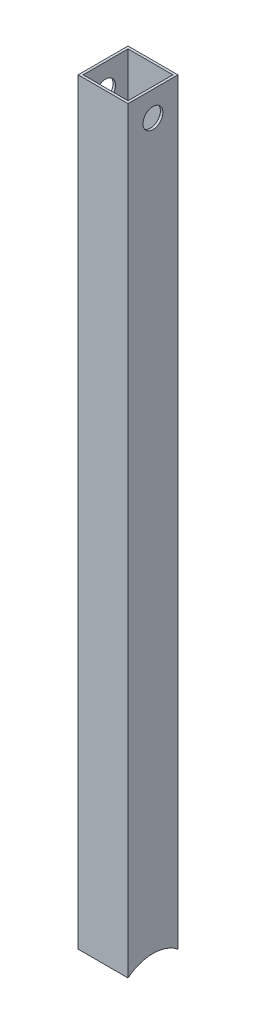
ISO-10303-21;
HEADER;
FILE_DESCRIPTION(('STEP AP214'),'2;1');
FILE_NAME('part.step','',(''),(''),'','','');
FILE_SCHEMA(('AUTOMOTIVE_DESIGN { 1 0 10303 214 1 1 1 1 }'));
ENDSEC;
DATA;
#1=APPLICATION_CONTEXT('core data for automotive mechanical design processes');
#2=APPLICATION_PROTOCOL_DEFINITION('international standard','automotive_design',2000,#1);
#3=PRODUCT_CONTEXT('',#1,'mechanical');
#4=PRODUCT('Part','Part','',(#3));
#5=PRODUCT_RELATED_PRODUCT_CATEGORY('part','',(#4));
#6=PRODUCT_DEFINITION_FORMATION('','',#4);
#7=PRODUCT_DEFINITION_CONTEXT('part definition',#1,'design');
#8=PRODUCT_DEFINITION('design','',#6,#7);
#9=PRODUCT_DEFINITION_SHAPE('','',#8);
#10=(LENGTH_UNIT() NAMED_UNIT(*) SI_UNIT(.MILLI.,.METRE.));
#11=(NAMED_UNIT(*) PLANE_ANGLE_UNIT() SI_UNIT($,.RADIAN.));
#12=(NAMED_UNIT(*) SI_UNIT($,.STERADIAN.) SOLID_ANGLE_UNIT());
#13=UNCERTAINTY_MEASURE_WITH_UNIT(LENGTH_MEASURE(1.E-05),#10,'distance_accuracy_value','');
#14=(GEOMETRIC_REPRESENTATION_CONTEXT(3) GLOBAL_UNCERTAINTY_ASSIGNED_CONTEXT((#13)) GLOBAL_UNIT_ASSIGNED_CONTEXT((#10,
#11,#12)) REPRESENTATION_CONTEXT('',''));
#15=CARTESIAN_POINT('',(0.,0.,0.));
#16=DIRECTION('',(0.,0.,1.));
#17=DIRECTION('',(1.,0.,0.));
#18=AXIS2_PLACEMENT_3D('',#15,#16,#17);
#19=CARTESIAN_POINT('',(25.,790.,-25.));
#20=DIRECTION('',(-1.,0.,0.));
#21=DIRECTION('',(0.,0.,1.));
#22=AXIS2_PLACEMENT_3D('',#19,#20,#21);
#23=PLANE('',#22);
#24=CARTESIAN_POINT('',(25.,764.99256211,0.));
#25=DIRECTION('',(1.,0.,0.));
#26=DIRECTION('',(0.,0.,-1.));
#27=AXIS2_PLACEMENT_3D('',#24,#25,#26);
#28=CIRCLE('',#27,9.99999999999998);
#29=CARTESIAN_POINT('',(25.,764.99256211,-9.99999999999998));
#30=VERTEX_POINT('',#29);
#31=EDGE_CURVE('E116',#30,#30,#28,.T.);
#32=ORIENTED_EDGE('',*,*,#31,.F.);
#33=EDGE_LOOP('',(#32));
#34=FACE_BOUND('',#33,.T.);
#35=DIRECTION('',(0.,-1.,0.));
#36=VECTOR('',#35,1.);
#37=CARTESIAN_POINT('',(25.,790.,25.));
#38=LINE('',#37,#36);
#39=CARTESIAN_POINT('',(25.,790.,25.));
#40=VERTEX_POINT('',#39);
#41=CARTESIAN_POINT('',(25.,31.2249899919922,25.));
#42=VERTEX_POINT('',#41);
#43=EDGE_CURVE('E123',#40,#42,#38,.T.);
#44=ORIENTED_EDGE('',*,*,#43,.T.);
#45=CARTESIAN_POINT('',(25.,0.,0.));
#46=DIRECTION('',(1.,0.,0.));
#47=DIRECTION('',(0.,0.,-1.));
#48=AXIS2_PLACEMENT_3D('',#45,#46,#47);
#49=CIRCLE('',#48,40.);
#50=CARTESIAN_POINT('',(25.,31.224989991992,-25.));
#51=VERTEX_POINT('',#50);
#52=EDGE_CURVE('E52',#51,#42,#49,.T.);
#53=ORIENTED_EDGE('',*,*,#52,.F.);
#54=DIRECTION('',(0.,-1.,0.));
#55=VECTOR('',#54,1.);
#56=CARTESIAN_POINT('',(25.,790.,-25.));
#57=LINE('',#56,#55);
#58=CARTESIAN_POINT('',(25.,790.,-25.));
#59=VERTEX_POINT('',#58);
#60=EDGE_CURVE('E45',#59,#51,#57,.T.);
#61=ORIENTED_EDGE('',*,*,#60,.F.);
#62=DIRECTION('',(0.,0.,-1.));
#63=VECTOR('',#62,1.);
#64=CARTESIAN_POINT('',(25.,790.,-25.));
#65=LINE('',#64,#63);
#66=EDGE_CURVE('E146',#40,#59,#65,.T.);
#67=ORIENTED_EDGE('',*,*,#66,.F.);
#68=EDGE_LOOP('',(#44,#53,#61,#67));
#69=FACE_BOUND('',#68,.T.);
#70=ADVANCED_FACE('F38',(#34,#69),#23,.F.);
#71=CARTESIAN_POINT('',(-25.,790.,-25.));
#72=DIRECTION('',(0.,0.,1.));
#73=DIRECTION('',(1.,0.,0.));
#74=AXIS2_PLACEMENT_3D('',#71,#72,#73);
#75=PLANE('',#74);
#76=ORIENTED_EDGE('',*,*,#60,.T.);
#77=DIRECTION('',(1.,0.,0.));
#78=VECTOR('',#77,1.);
#79=CARTESIAN_POINT('',(-25.,31.224989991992,-25.));
#80=LINE('',#79,#78);
#81=CARTESIAN_POINT('',(-25.,31.224989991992,-25.));
#82=VERTEX_POINT('',#81);
#83=EDGE_CURVE('E102',#51,#82,#80,.F.);
#84=ORIENTED_EDGE('',*,*,#83,.T.);
#85=DIRECTION('',(0.,-1.,0.));
#86=VECTOR('',#85,1.);
#87=CARTESIAN_POINT('',(-25.,790.,-25.));
#88=LINE('',#87,#86);
#89=CARTESIAN_POINT('',(-25.,790.,-25.));
#90=VERTEX_POINT('',#89);
#91=EDGE_CURVE('E113',#90,#82,#88,.T.);
#92=ORIENTED_EDGE('',*,*,#91,.F.);
#93=DIRECTION('',(-1.,0.,0.));
#94=VECTOR('',#93,1.);
#95=CARTESIAN_POINT('',(-25.,790.,-25.));
#96=LINE('',#95,#94);
#97=EDGE_CURVE('E166',#59,#90,#96,.T.);
#98=ORIENTED_EDGE('',*,*,#97,.F.);
#99=EDGE_LOOP('',(#76,#84,#92,#98));
#100=FACE_BOUND('',#99,.T.);
#101=ADVANCED_FACE('F112',(#100),#75,.F.);
#102=CARTESIAN_POINT('',(-25.,790.,-25.));
#103=DIRECTION('',(1.,0.,0.));
#104=DIRECTION('',(0.,0.,-1.));
#105=AXIS2_PLACEMENT_3D('',#102,#103,#104);
#106=PLANE('',#105);
#107=CARTESIAN_POINT('',(-25.,764.99256211,0.));
#108=DIRECTION('',(1.,0.,0.));
#109=DIRECTION('',(0.,0.,-1.));
#110=AXIS2_PLACEMENT_3D('',#107,#108,#109);
#111=CIRCLE('',#110,9.99999999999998);
#112=CARTESIAN_POINT('',(-25.,764.99256211,-9.99999999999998));
#113=VERTEX_POINT('',#112);
#114=EDGE_CURVE('E129',#113,#113,#111,.T.);
#115=ORIENTED_EDGE('',*,*,#114,.T.);
#116=EDGE_LOOP('',(#115));
#117=FACE_BOUND('',#116,.T.);
#118=ORIENTED_EDGE('',*,*,#91,.T.);
#119=CARTESIAN_POINT('',(-25.,0.,0.));
#120=DIRECTION('',(1.,0.,0.));
#121=DIRECTION('',(0.,0.,-1.));
#122=AXIS2_PLACEMENT_3D('',#119,#120,#121);
#123=CIRCLE('',#122,40.);
#124=CARTESIAN_POINT('',(-25.,31.224989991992,25.));
#125=VERTEX_POINT('',#124);
#126=EDGE_CURVE('E99',#82,#125,#123,.T.);
#127=ORIENTED_EDGE('',*,*,#126,.T.);
#128=DIRECTION('',(0.,-1.,0.));
#129=VECTOR('',#128,1.);
#130=CARTESIAN_POINT('',(-25.,790.,25.));
#131=LINE('',#130,#129);
#132=CARTESIAN_POINT('',(-25.,790.,25.));
#133=VERTEX_POINT('',#132);
#134=EDGE_CURVE('E120',#133,#125,#131,.T.);
#135=ORIENTED_EDGE('',*,*,#134,.F.);
#136=DIRECTION('',(0.,0.,1.));
#137=VECTOR('',#136,1.);
#138=CARTESIAN_POINT('',(-25.,790.,-25.));
#139=LINE('',#138,#137);
#140=EDGE_CURVE('E119',#90,#133,#139,.T.);
#141=ORIENTED_EDGE('',*,*,#140,.F.);
#142=EDGE_LOOP('',(#118,#127,#135,#141));
#143=FACE_BOUND('',#142,.T.);
#144=ADVANCED_FACE('F118',(#117,#143),#106,.F.);
#145=CARTESIAN_POINT('',(-25.,790.,25.));
#146=DIRECTION('',(0.,0.,-1.));
#147=DIRECTION('',(-1.,0.,0.));
#148=AXIS2_PLACEMENT_3D('',#145,#146,#147);
#149=PLANE('',#148);
#150=ORIENTED_EDGE('',*,*,#134,.T.);
#151=DIRECTION('',(1.,0.,0.));
#152=VECTOR('',#151,1.);
#153=CARTESIAN_POINT('',(-25.,31.224989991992,25.));
#154=LINE('',#153,#152);
#155=EDGE_CURVE('E103',#125,#42,#154,.T.);
#156=ORIENTED_EDGE('',*,*,#155,.T.);
#157=ORIENTED_EDGE('',*,*,#43,.F.);
#158=DIRECTION('',(1.,0.,0.));
#159=VECTOR('',#158,1.);
#160=CARTESIAN_POINT('',(-25.,790.,25.));
#161=LINE('',#160,#159);
#162=EDGE_CURVE('E169',#133,#40,#161,.T.);
#163=ORIENTED_EDGE('',*,*,#162,.F.);
#164=EDGE_LOOP('',(#150,#156,#157,#163));
#165=FACE_BOUND('',#164,.T.);
#166=ADVANCED_FACE('F176',(#165),#149,.F.);
#167=CARTESIAN_POINT('',(0.,790.,0.));
#168=DIRECTION('',(0.,1.,0.));
#169=DIRECTION('',(0.,0.,1.));
#170=AXIS2_PLACEMENT_3D('',#167,#168,#169);
#171=PLANE('',#170);
#172=DIRECTION('',(0.,0.,-1.));
#173=VECTOR('',#172,1.);
#174=CARTESIAN_POINT('',(22.5,790.,-25.));
#175=LINE('',#174,#173);
#176=CARTESIAN_POINT('',(22.5,790.,22.5));
#177=VERTEX_POINT('',#176);
#178=CARTESIAN_POINT('',(22.5,790.,-22.5));
#179=VERTEX_POINT('',#178);
#180=EDGE_CURVE('E133',#177,#179,#175,.T.);
#181=ORIENTED_EDGE('',*,*,#180,.F.);
#182=DIRECTION('',(1.,0.,0.));
#183=VECTOR('',#182,1.);
#184=CARTESIAN_POINT('',(-25.,790.,22.5));
#185=LINE('',#184,#183);
#186=CARTESIAN_POINT('',(-22.5,790.,22.5));
#187=VERTEX_POINT('',#186);
#188=EDGE_CURVE('E152',#187,#177,#185,.T.);
#189=ORIENTED_EDGE('',*,*,#188,.F.);
#190=DIRECTION('',(0.,0.,1.));
#191=VECTOR('',#190,1.);
#192=CARTESIAN_POINT('',(-22.5,790.,-25.));
#193=LINE('',#192,#191);
#194=CARTESIAN_POINT('',(-22.5,790.,-22.5));
#195=VERTEX_POINT('',#194);
#196=EDGE_CURVE('E160',#195,#187,#193,.T.);
#197=ORIENTED_EDGE('',*,*,#196,.F.);
#198=DIRECTION('',(-1.,0.,0.));
#199=VECTOR('',#198,1.);
#200=CARTESIAN_POINT('',(-25.,790.,-22.5));
#201=LINE('',#200,#199);
#202=EDGE_CURVE('E158',#179,#195,#201,.T.);
#203=ORIENTED_EDGE('',*,*,#202,.F.);
#204=EDGE_LOOP('',(#181,#189,#197,#203));
#205=FACE_BOUND('',#204,.T.);
#206=ORIENTED_EDGE('',*,*,#66,.T.);
#207=ORIENTED_EDGE('',*,*,#97,.T.);
#208=ORIENTED_EDGE('',*,*,#140,.T.);
#209=ORIENTED_EDGE('',*,*,#162,.T.);
#210=EDGE_LOOP('',(#206,#207,#208,#209));
#211=FACE_BOUND('',#210,.T.);
#212=ADVANCED_FACE('F196',(#205,#211),#171,.T.);
#213=CARTESIAN_POINT('',(22.5,790.,-25.));
#214=DIRECTION('',(-1.,0.,0.));
#215=DIRECTION('',(0.,0.,1.));
#216=AXIS2_PLACEMENT_3D('',#213,#214,#215);
#217=PLANE('',#216);
#218=CARTESIAN_POINT('',(22.5,0.,0.));
#219=DIRECTION('',(-1.,0.,0.));
#220=DIRECTION('',(0.,0.,1.));
#221=AXIS2_PLACEMENT_3D('',#218,#219,#220);
#222=CIRCLE('',#221,40.);
#223=CARTESIAN_POINT('',(22.5,33.0718913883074,22.5));
#224=VERTEX_POINT('',#223);
#225=CARTESIAN_POINT('',(22.5,33.0718913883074,-22.5));
#226=VERTEX_POINT('',#225);
#227=EDGE_CURVE('E177',#224,#226,#222,.T.);
#228=ORIENTED_EDGE('',*,*,#227,.F.);
#229=DIRECTION('',(0.,-1.,0.));
#230=VECTOR('',#229,1.);
#231=CARTESIAN_POINT('',(22.5,790.,22.5));
#232=LINE('',#231,#230);
#233=EDGE_CURVE('E148',#177,#224,#232,.T.);
#234=ORIENTED_EDGE('',*,*,#233,.F.);
#235=ORIENTED_EDGE('',*,*,#180,.T.);
#236=DIRECTION('',(0.,-1.,0.));
#237=VECTOR('',#236,1.);
#238=CARTESIAN_POINT('',(22.5,790.,-22.5));
#239=LINE('',#238,#237);
#240=EDGE_CURVE('E143',#179,#226,#239,.T.);
#241=ORIENTED_EDGE('',*,*,#240,.T.);
#242=EDGE_LOOP('',(#228,#234,#235,#241));
#243=FACE_BOUND('',#242,.T.);
#244=CARTESIAN_POINT('',(22.5,764.99256211,0.));
#245=DIRECTION('',(-1.,0.,0.));
#246=DIRECTION('',(0.,0.,1.));
#247=AXIS2_PLACEMENT_3D('',#244,#245,#246);
#248=CIRCLE('',#247,9.99999999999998);
#249=CARTESIAN_POINT('',(22.5,764.99256211,9.99999999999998));
#250=VERTEX_POINT('',#249);
#251=EDGE_CURVE('E128',#250,#250,#248,.T.);
#252=ORIENTED_EDGE('',*,*,#251,.F.);
#253=EDGE_LOOP('',(#252));
#254=FACE_BOUND('',#253,.T.);
#255=ADVANCED_FACE('F203',(#243,#254),#217,.T.);
#256=CARTESIAN_POINT('',(-25.,790.,-22.5));
#257=DIRECTION('',(0.,0.,1.));
#258=DIRECTION('',(1.,0.,0.));
#259=AXIS2_PLACEMENT_3D('',#256,#257,#258);
#260=PLANE('',#259);
#261=DIRECTION('',(1.,0.,0.));
#262=VECTOR('',#261,1.);
#263=CARTESIAN_POINT('',(-25.,33.0718913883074,-22.5));
#264=LINE('',#263,#262);
#265=CARTESIAN_POINT('',(-22.5,33.0718913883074,-22.5));
#266=VERTEX_POINT('',#265);
#267=EDGE_CURVE('E178',#226,#266,#264,.F.);
#268=ORIENTED_EDGE('',*,*,#267,.F.);
#269=ORIENTED_EDGE('',*,*,#240,.F.);
#270=ORIENTED_EDGE('',*,*,#202,.T.);
#271=DIRECTION('',(0.,-1.,0.));
#272=VECTOR('',#271,1.);
#273=CARTESIAN_POINT('',(-22.5,790.,-22.5));
#274=LINE('',#273,#272);
#275=EDGE_CURVE('E147',#195,#266,#274,.T.);
#276=ORIENTED_EDGE('',*,*,#275,.T.);
#277=EDGE_LOOP('',(#268,#269,#270,#276));
#278=FACE_BOUND('',#277,.T.);
#279=ADVANCED_FACE('F192',(#278),#260,.T.);
#280=CARTESIAN_POINT('',(-22.5,790.,-25.));
#281=DIRECTION('',(1.,0.,0.));
#282=DIRECTION('',(0.,0.,-1.));
#283=AXIS2_PLACEMENT_3D('',#280,#281,#282);
#284=PLANE('',#283);
#285=CARTESIAN_POINT('',(-22.5,0.,0.));
#286=DIRECTION('',(1.,0.,0.));
#287=DIRECTION('',(0.,0.,-1.));
#288=AXIS2_PLACEMENT_3D('',#285,#286,#287);
#289=CIRCLE('',#288,40.);
#290=CARTESIAN_POINT('',(-22.5,33.0718913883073,22.5));
#291=VERTEX_POINT('',#290);
#292=EDGE_CURVE('E59',#266,#291,#289,.T.);
#293=ORIENTED_EDGE('',*,*,#292,.F.);
#294=ORIENTED_EDGE('',*,*,#275,.F.);
#295=ORIENTED_EDGE('',*,*,#196,.T.);
#296=DIRECTION('',(0.,-1.,0.));
#297=VECTOR('',#296,1.);
#298=CARTESIAN_POINT('',(-22.5,790.,22.5));
#299=LINE('',#298,#297);
#300=EDGE_CURVE('E151',#187,#291,#299,.T.);
#301=ORIENTED_EDGE('',*,*,#300,.T.);
#302=EDGE_LOOP('',(#293,#294,#295,#301));
#303=FACE_BOUND('',#302,.T.);
#304=CARTESIAN_POINT('',(-22.5,764.99256211,0.));
#305=DIRECTION('',(1.,0.,0.));
#306=DIRECTION('',(0.,0.,-1.));
#307=AXIS2_PLACEMENT_3D('',#304,#305,#306);
#308=CIRCLE('',#307,9.99999999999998);
#309=CARTESIAN_POINT('',(-22.5,764.99256211,-9.99999999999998));
#310=VERTEX_POINT('',#309);
#311=EDGE_CURVE('E126',#310,#310,#308,.T.);
#312=ORIENTED_EDGE('',*,*,#311,.F.);
#313=EDGE_LOOP('',(#312));
#314=FACE_BOUND('',#313,.T.);
#315=ADVANCED_FACE('F189',(#303,#314),#284,.T.);
#316=CARTESIAN_POINT('',(-25.,790.,22.5));
#317=DIRECTION('',(0.,0.,-1.));
#318=DIRECTION('',(-1.,0.,0.));
#319=AXIS2_PLACEMENT_3D('',#316,#317,#318);
#320=PLANE('',#319);
#321=DIRECTION('',(1.,0.,0.));
#322=VECTOR('',#321,1.);
#323=CARTESIAN_POINT('',(-25.,33.0718913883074,22.5));
#324=LINE('',#323,#322);
#325=EDGE_CURVE('E11',#291,#224,#324,.T.);
#326=ORIENTED_EDGE('',*,*,#325,.F.);
#327=ORIENTED_EDGE('',*,*,#300,.F.);
#328=ORIENTED_EDGE('',*,*,#188,.T.);
#329=ORIENTED_EDGE('',*,*,#233,.T.);
#330=EDGE_LOOP('',(#326,#327,#328,#329));
#331=FACE_BOUND('',#330,.T.);
#332=ADVANCED_FACE('F201',(#331),#320,.T.);
#333=CARTESIAN_POINT('',(-25.,764.99256211,0.));
#334=DIRECTION('',(1.,0.,0.));
#335=DIRECTION('',(0.,0.,-1.));
#336=AXIS2_PLACEMENT_3D('',#333,#334,#335);
#337=CYLINDRICAL_SURFACE('',#336,9.99999999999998);
#338=ORIENTED_EDGE('',*,*,#311,.T.);
#339=EDGE_LOOP('',(#338));
#340=FACE_BOUND('',#339,.T.);
#341=ORIENTED_EDGE('',*,*,#114,.F.);
#342=EDGE_LOOP('',(#341));
#343=FACE_BOUND('',#342,.T.);
#344=ADVANCED_FACE('F212',(#340,#343),#337,.F.);
#345=ORIENTED_EDGE('',*,*,#251,.T.);
#346=EDGE_LOOP('',(#345));
#347=FACE_BOUND('',#346,.T.);
#348=ORIENTED_EDGE('',*,*,#31,.T.);
#349=EDGE_LOOP('',(#348));
#350=FACE_BOUND('',#349,.T.);
#351=ADVANCED_FACE('F209',(#347,#350),#337,.F.);
#352=CARTESIAN_POINT('',(-25.,0.,0.));
#353=DIRECTION('',(1.,0.,0.));
#354=DIRECTION('',(0.,0.,-1.));
#355=AXIS2_PLACEMENT_3D('',#352,#353,#354);
#356=CYLINDRICAL_SURFACE('',#355,40.);
#357=ORIENTED_EDGE('',*,*,#227,.T.);
#358=ORIENTED_EDGE('',*,*,#267,.T.);
#359=ORIENTED_EDGE('',*,*,#292,.T.);
#360=ORIENTED_EDGE('',*,*,#325,.T.);
#361=EDGE_LOOP('',(#357,#358,#359,#360));
#362=FACE_BOUND('',#361,.T.);
#363=ORIENTED_EDGE('',*,*,#52,.T.);
#364=ORIENTED_EDGE('',*,*,#155,.F.);
#365=ORIENTED_EDGE('',*,*,#126,.F.);
#366=ORIENTED_EDGE('',*,*,#83,.F.);
#367=EDGE_LOOP('',(#363,#364,#365,#366));
#368=FACE_BOUND('',#367,.T.);
#369=ADVANCED_FACE('F101',(#362,#368),#356,.F.);
#370=CLOSED_SHELL('',(#70,#101,#144,#166,#212,#255,#279,#315,#332,#344,#351,#369));
#371=MANIFOLD_SOLID_BREP('B2',#370);
#372=ADVANCED_BREP_SHAPE_REPRESENTATION('',(#18,#371),#14);
#373=SHAPE_DEFINITION_REPRESENTATION(#9,#372);
ENDSEC;
END-ISO-10303-21;
